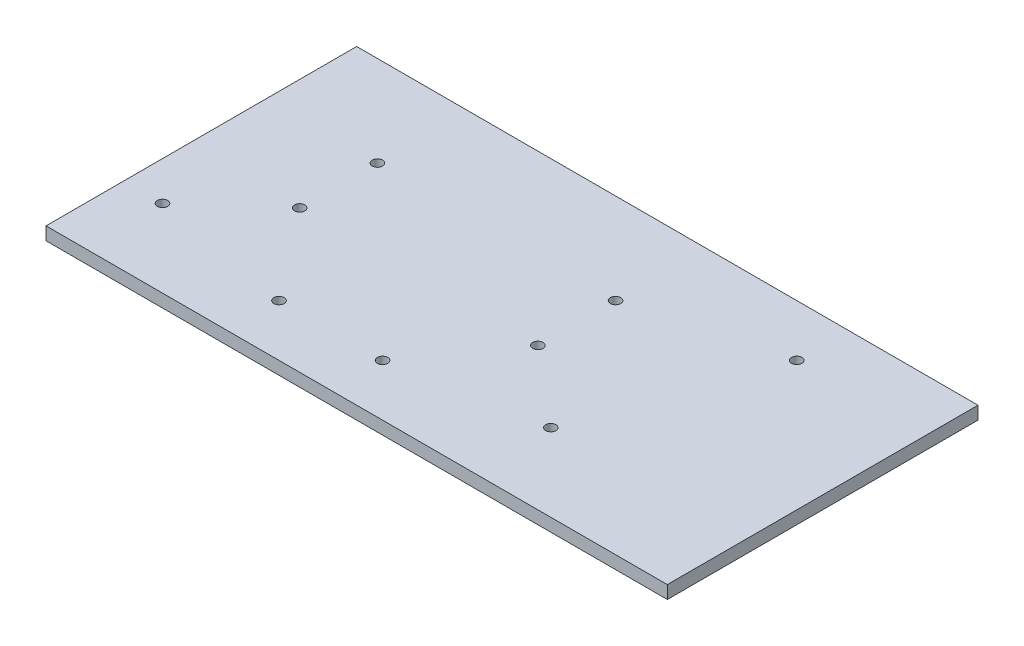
ISO-10303-21;
HEADER;
FILE_DESCRIPTION(('STEP AP214'),'2;1');
FILE_NAME('part.step','',(''),(''),'','','');
FILE_SCHEMA(('AUTOMOTIVE_DESIGN { 1 0 10303 214 1 1 1 1 }'));
ENDSEC;
DATA;
#1=APPLICATION_CONTEXT('core data for automotive mechanical design processes');
#2=APPLICATION_PROTOCOL_DEFINITION('international standard','automotive_design',2000,#1);
#3=PRODUCT_CONTEXT('',#1,'mechanical');
#4=PRODUCT('Part','Part','',(#3));
#5=PRODUCT_RELATED_PRODUCT_CATEGORY('part','',(#4));
#6=PRODUCT_DEFINITION_FORMATION('','',#4);
#7=PRODUCT_DEFINITION_CONTEXT('part definition',#1,'design');
#8=PRODUCT_DEFINITION('design','',#6,#7);
#9=PRODUCT_DEFINITION_SHAPE('','',#8);
#10=(LENGTH_UNIT() NAMED_UNIT(*) SI_UNIT(.MILLI.,.METRE.));
#11=(NAMED_UNIT(*) PLANE_ANGLE_UNIT() SI_UNIT($,.RADIAN.));
#12=(NAMED_UNIT(*) SI_UNIT($,.STERADIAN.) SOLID_ANGLE_UNIT());
#13=UNCERTAINTY_MEASURE_WITH_UNIT(LENGTH_MEASURE(1.E-05),#10,'distance_accuracy_value','');
#14=(GEOMETRIC_REPRESENTATION_CONTEXT(3) GLOBAL_UNCERTAINTY_ASSIGNED_CONTEXT((#13)) GLOBAL_UNIT_ASSIGNED_CONTEXT((#10,
#11,#12)) REPRESENTATION_CONTEXT('',''));
#15=CARTESIAN_POINT('',(0.,0.,0.));
#16=DIRECTION('',(0.,0.,1.));
#17=DIRECTION('',(1.,0.,0.));
#18=AXIS2_PLACEMENT_3D('',#15,#16,#17);
#19=CARTESIAN_POINT('',(0.,5.,-120.));
#20=DIRECTION('',(0.,-1.,0.));
#21=DIRECTION('',(0.,0.,-1.));
#22=AXIS2_PLACEMENT_3D('',#19,#20,#21);
#23=PLANE('',#22);
#24=CARTESIAN_POINT('',(43.,5.,-55.));
#25=DIRECTION('',(0.,1.,0.));
#26=DIRECTION('',(0.,0.,1.));
#27=AXIS2_PLACEMENT_3D('',#24,#25,#26);
#28=CIRCLE('',#27,2.);
#29=CARTESIAN_POINT('',(43.,5.,-53.));
#30=VERTEX_POINT('',#29);
#31=EDGE_CURVE('E139',#30,#30,#28,.T.);
#32=ORIENTED_EDGE('',*,*,#31,.F.);
#33=EDGE_LOOP('',(#32));
#34=FACE_BOUND('',#33,.T.);
#35=CARTESIAN_POINT('',(110.,5.,-20.));
#36=DIRECTION('',(0.,1.,0.));
#37=DIRECTION('',(0.,0.,1.));
#38=AXIS2_PLACEMENT_3D('',#35,#36,#37);
#39=CIRCLE('',#38,2.);
#40=CARTESIAN_POINT('',(110.,5.,-18.));
#41=VERTEX_POINT('',#40);
#42=EDGE_CURVE('E153',#41,#41,#39,.T.);
#43=ORIENTED_EDGE('',*,*,#42,.F.);
#44=EDGE_LOOP('',(#43));
#45=FACE_BOUND('',#44,.T.);
#46=CARTESIAN_POINT('',(15.,5.,-30.));
#47=DIRECTION('',(0.,1.,0.));
#48=DIRECTION('',(0.,0.,1.));
#49=AXIS2_PLACEMENT_3D('',#46,#47,#48);
#50=CIRCLE('',#49,2.);
#51=CARTESIAN_POINT('',(15.,5.,-28.));
#52=VERTEX_POINT('',#51);
#53=EDGE_CURVE('E163',#52,#52,#50,.T.);
#54=ORIENTED_EDGE('',*,*,#53,.F.);
#55=EDGE_LOOP('',(#54));
#56=FACE_BOUND('',#55,.T.);
#57=CARTESIAN_POINT('',(135.,5.,-85.));
#58=DIRECTION('',(0.,1.,0.));
#59=DIRECTION('',(0.,0.,1.));
#60=AXIS2_PLACEMENT_3D('',#57,#58,#59);
#61=CIRCLE('',#60,2.);
#62=CARTESIAN_POINT('',(135.,5.,-83.));
#63=VERTEX_POINT('',#62);
#64=EDGE_CURVE('E173',#63,#63,#61,.T.);
#65=ORIENTED_EDGE('',*,*,#64,.F.);
#66=EDGE_LOOP('',(#65));
#67=FACE_BOUND('',#66,.T.);
#68=DIRECTION('',(0.,0.,1.));
#69=VECTOR('',#68,1.);
#70=CARTESIAN_POINT('',(0.,5.,0.));
#71=LINE('',#70,#69);
#72=CARTESIAN_POINT('',(0.,5.,-120.));
#73=VERTEX_POINT('',#72);
#74=CARTESIAN_POINT('',(0.,5.,0.));
#75=VERTEX_POINT('',#74);
#76=EDGE_CURVE('E101',#73,#75,#71,.T.);
#77=ORIENTED_EDGE('',*,*,#76,.T.);
#78=DIRECTION('',(1.,0.,0.));
#79=VECTOR('',#78,1.);
#80=CARTESIAN_POINT('',(0.,5.,0.));
#81=LINE('',#80,#79);
#82=CARTESIAN_POINT('',(240.,5.,0.));
#83=VERTEX_POINT('',#82);
#84=EDGE_CURVE('E86',#75,#83,#81,.T.);
#85=ORIENTED_EDGE('',*,*,#84,.T.);
#86=DIRECTION('',(0.,0.,-1.));
#87=VECTOR('',#86,1.);
#88=CARTESIAN_POINT('',(240.,5.,0.));
#89=LINE('',#88,#87);
#90=CARTESIAN_POINT('',(240.,5.,-120.));
#91=VERTEX_POINT('',#90);
#92=EDGE_CURVE('E52',#83,#91,#89,.T.);
#93=ORIENTED_EDGE('',*,*,#92,.T.);
#94=DIRECTION('',(-1.,0.,0.));
#95=VECTOR('',#94,1.);
#96=CARTESIAN_POINT('',(0.,5.,-120.));
#97=LINE('',#96,#95);
#98=EDGE_CURVE('E47',#91,#73,#97,.T.);
#99=ORIENTED_EDGE('',*,*,#98,.T.);
#100=EDGE_LOOP('',(#77,#85,#93,#99));
#101=FACE_BOUND('',#100,.T.);
#102=CARTESIAN_POINT('',(190.,5.,-100.));
#103=DIRECTION('',(0.,1.,0.));
#104=DIRECTION('',(0.,0.,1.));
#105=AXIS2_PLACEMENT_3D('',#102,#103,#104);
#106=CIRCLE('',#105,2.);
#107=CARTESIAN_POINT('',(190.,5.,-98.));
#108=VERTEX_POINT('',#107);
#109=EDGE_CURVE('E91',#108,#108,#106,.T.);
#110=ORIENTED_EDGE('',*,*,#109,.F.);
#111=EDGE_LOOP('',(#110));
#112=FACE_BOUND('',#111,.T.);
#113=CARTESIAN_POINT('',(43.,5.,-85.));
#114=DIRECTION('',(0.,1.,0.));
#115=DIRECTION('',(0.,0.,1.));
#116=AXIS2_PLACEMENT_3D('',#113,#114,#115);
#117=CIRCLE('',#116,2.);
#118=CARTESIAN_POINT('',(43.,5.,-83.));
#119=VERTEX_POINT('',#118);
#120=EDGE_CURVE('E122',#119,#119,#117,.T.);
#121=ORIENTED_EDGE('',*,*,#120,.F.);
#122=EDGE_LOOP('',(#121));
#123=FACE_BOUND('',#122,.T.);
#124=CARTESIAN_POINT('',(70.,5.,-20.));
#125=DIRECTION('',(0.,1.,0.));
#126=DIRECTION('',(0.,0.,1.));
#127=AXIS2_PLACEMENT_3D('',#124,#125,#126);
#128=CIRCLE('',#127,2.);
#129=CARTESIAN_POINT('',(70.,5.,-18.));
#130=VERTEX_POINT('',#129);
#131=EDGE_CURVE('E126',#130,#130,#128,.T.);
#132=ORIENTED_EDGE('',*,*,#131,.F.);
#133=EDGE_LOOP('',(#132));
#134=FACE_BOUND('',#133,.T.);
#135=CARTESIAN_POINT('',(165.,5.,-30.));
#136=DIRECTION('',(0.,1.,0.));
#137=DIRECTION('',(0.,0.,1.));
#138=AXIS2_PLACEMENT_3D('',#135,#136,#137);
#139=CIRCLE('',#138,2.);
#140=CARTESIAN_POINT('',(165.,5.,-28.));
#141=VERTEX_POINT('',#140);
#142=EDGE_CURVE('E130',#141,#141,#139,.T.);
#143=ORIENTED_EDGE('',*,*,#142,.F.);
#144=EDGE_LOOP('',(#143));
#145=FACE_BOUND('',#144,.T.);
#146=CARTESIAN_POINT('',(135.,5.,-55.));
#147=DIRECTION('',(0.,1.,0.));
#148=DIRECTION('',(0.,0.,1.));
#149=AXIS2_PLACEMENT_3D('',#146,#147,#148);
#150=CIRCLE('',#149,2.);
#151=CARTESIAN_POINT('',(135.,5.,-53.));
#152=VERTEX_POINT('',#151);
#153=EDGE_CURVE('E133',#152,#152,#150,.T.);
#154=ORIENTED_EDGE('',*,*,#153,.F.);
#155=EDGE_LOOP('',(#154));
#156=FACE_BOUND('',#155,.T.);
#157=ADVANCED_FACE('F32',(#34,#45,#56,#67,#101,#112,#123,#134,#145,#156),#23,.F.);
#158=CARTESIAN_POINT('',(0.,0.,-120.));
#159=DIRECTION('',(0.,-1.,0.));
#160=DIRECTION('',(0.,0.,-1.));
#161=AXIS2_PLACEMENT_3D('',#158,#159,#160);
#162=PLANE('',#161);
#163=CARTESIAN_POINT('',(43.,0.,-55.));
#164=DIRECTION('',(0.,1.,0.));
#165=DIRECTION('',(0.,0.,1.));
#166=AXIS2_PLACEMENT_3D('',#163,#164,#165);
#167=CIRCLE('',#166,2.);
#168=CARTESIAN_POINT('',(43.,0.,-53.));
#169=VERTEX_POINT('',#168);
#170=EDGE_CURVE('E135',#169,#169,#167,.T.);
#171=ORIENTED_EDGE('',*,*,#170,.T.);
#172=EDGE_LOOP('',(#171));
#173=FACE_BOUND('',#172,.T.);
#174=CARTESIAN_POINT('',(110.,0.,-20.));
#175=DIRECTION('',(0.,1.,0.));
#176=DIRECTION('',(0.,0.,1.));
#177=AXIS2_PLACEMENT_3D('',#174,#175,#176);
#178=CIRCLE('',#177,2.);
#179=CARTESIAN_POINT('',(110.,0.,-18.));
#180=VERTEX_POINT('',#179);
#181=EDGE_CURVE('E150',#180,#180,#178,.T.);
#182=ORIENTED_EDGE('',*,*,#181,.T.);
#183=EDGE_LOOP('',(#182));
#184=FACE_BOUND('',#183,.T.);
#185=CARTESIAN_POINT('',(15.,0.,-30.));
#186=DIRECTION('',(0.,1.,0.));
#187=DIRECTION('',(0.,0.,1.));
#188=AXIS2_PLACEMENT_3D('',#185,#186,#187);
#189=CIRCLE('',#188,2.);
#190=CARTESIAN_POINT('',(15.,0.,-28.));
#191=VERTEX_POINT('',#190);
#192=EDGE_CURVE('E160',#191,#191,#189,.T.);
#193=ORIENTED_EDGE('',*,*,#192,.T.);
#194=EDGE_LOOP('',(#193));
#195=FACE_BOUND('',#194,.T.);
#196=CARTESIAN_POINT('',(135.,0.,-85.));
#197=DIRECTION('',(0.,1.,0.));
#198=DIRECTION('',(0.,0.,1.));
#199=AXIS2_PLACEMENT_3D('',#196,#197,#198);
#200=CIRCLE('',#199,2.);
#201=CARTESIAN_POINT('',(135.,0.,-83.));
#202=VERTEX_POINT('',#201);
#203=EDGE_CURVE('E170',#202,#202,#200,.T.);
#204=ORIENTED_EDGE('',*,*,#203,.T.);
#205=EDGE_LOOP('',(#204));
#206=FACE_BOUND('',#205,.T.);
#207=DIRECTION('',(0.,0.,1.));
#208=VECTOR('',#207,1.);
#209=CARTESIAN_POINT('',(0.,0.,0.));
#210=LINE('',#209,#208);
#211=CARTESIAN_POINT('',(0.,0.,-120.));
#212=VERTEX_POINT('',#211);
#213=CARTESIAN_POINT('',(0.,0.,0.));
#214=VERTEX_POINT('',#213);
#215=EDGE_CURVE('E78',#212,#214,#210,.T.);
#216=ORIENTED_EDGE('',*,*,#215,.F.);
#217=DIRECTION('',(-1.,0.,0.));
#218=VECTOR('',#217,1.);
#219=CARTESIAN_POINT('',(0.,0.,-120.));
#220=LINE('',#219,#218);
#221=CARTESIAN_POINT('',(240.,0.,-120.));
#222=VERTEX_POINT('',#221);
#223=EDGE_CURVE('E99',#222,#212,#220,.T.);
#224=ORIENTED_EDGE('',*,*,#223,.F.);
#225=DIRECTION('',(0.,0.,-1.));
#226=VECTOR('',#225,1.);
#227=CARTESIAN_POINT('',(240.,0.,0.));
#228=LINE('',#227,#226);
#229=CARTESIAN_POINT('',(240.,0.,0.));
#230=VERTEX_POINT('',#229);
#231=EDGE_CURVE('E79',#230,#222,#228,.T.);
#232=ORIENTED_EDGE('',*,*,#231,.F.);
#233=DIRECTION('',(1.,0.,0.));
#234=VECTOR('',#233,1.);
#235=CARTESIAN_POINT('',(0.,0.,0.));
#236=LINE('',#235,#234);
#237=EDGE_CURVE('E73',#214,#230,#236,.T.);
#238=ORIENTED_EDGE('',*,*,#237,.F.);
#239=EDGE_LOOP('',(#216,#224,#232,#238));
#240=FACE_BOUND('',#239,.T.);
#241=CARTESIAN_POINT('',(190.,0.,-100.));
#242=DIRECTION('',(0.,1.,0.));
#243=DIRECTION('',(0.,0.,1.));
#244=AXIS2_PLACEMENT_3D('',#241,#242,#243);
#245=CIRCLE('',#244,2.);
#246=CARTESIAN_POINT('',(190.,0.,-98.));
#247=VERTEX_POINT('',#246);
#248=EDGE_CURVE('E94',#247,#247,#245,.T.);
#249=ORIENTED_EDGE('',*,*,#248,.T.);
#250=EDGE_LOOP('',(#249));
#251=FACE_BOUND('',#250,.T.);
#252=CARTESIAN_POINT('',(43.,0.,-85.));
#253=DIRECTION('',(0.,1.,0.));
#254=DIRECTION('',(0.,0.,1.));
#255=AXIS2_PLACEMENT_3D('',#252,#253,#254);
#256=CIRCLE('',#255,2.);
#257=CARTESIAN_POINT('',(43.,0.,-83.));
#258=VERTEX_POINT('',#257);
#259=EDGE_CURVE('E166',#258,#258,#256,.T.);
#260=ORIENTED_EDGE('',*,*,#259,.T.);
#261=EDGE_LOOP('',(#260));
#262=FACE_BOUND('',#261,.T.);
#263=CARTESIAN_POINT('',(70.,0.,-20.));
#264=DIRECTION('',(0.,1.,0.));
#265=DIRECTION('',(0.,0.,1.));
#266=AXIS2_PLACEMENT_3D('',#263,#264,#265);
#267=CIRCLE('',#266,2.);
#268=CARTESIAN_POINT('',(70.,0.,-18.));
#269=VERTEX_POINT('',#268);
#270=EDGE_CURVE('E156',#269,#269,#267,.T.);
#271=ORIENTED_EDGE('',*,*,#270,.T.);
#272=EDGE_LOOP('',(#271));
#273=FACE_BOUND('',#272,.T.);
#274=CARTESIAN_POINT('',(165.,0.,-30.));
#275=DIRECTION('',(0.,1.,0.));
#276=DIRECTION('',(0.,0.,1.));
#277=AXIS2_PLACEMENT_3D('',#274,#275,#276);
#278=CIRCLE('',#277,2.);
#279=CARTESIAN_POINT('',(165.,0.,-28.));
#280=VERTEX_POINT('',#279);
#281=EDGE_CURVE('E146',#280,#280,#278,.T.);
#282=ORIENTED_EDGE('',*,*,#281,.T.);
#283=EDGE_LOOP('',(#282));
#284=FACE_BOUND('',#283,.T.);
#285=CARTESIAN_POINT('',(135.,0.,-55.));
#286=DIRECTION('',(0.,1.,0.));
#287=DIRECTION('',(0.,0.,1.));
#288=AXIS2_PLACEMENT_3D('',#285,#286,#287);
#289=CIRCLE('',#288,2.);
#290=CARTESIAN_POINT('',(135.,0.,-53.));
#291=VERTEX_POINT('',#290);
#292=EDGE_CURVE('E136',#291,#291,#289,.T.);
#293=ORIENTED_EDGE('',*,*,#292,.T.);
#294=EDGE_LOOP('',(#293));
#295=FACE_BOUND('',#294,.T.);
#296=ADVANCED_FACE('F74',(#173,#184,#195,#206,#240,#251,#262,#273,#284,#295),#162,.T.);
#297=CARTESIAN_POINT('',(0.,5.,0.));
#298=DIRECTION('',(1.,0.,0.));
#299=DIRECTION('',(0.,0.,-1.));
#300=AXIS2_PLACEMENT_3D('',#297,#298,#299);
#301=PLANE('',#300);
#302=ORIENTED_EDGE('',*,*,#215,.T.);
#303=DIRECTION('',(0.,-1.,0.));
#304=VECTOR('',#303,1.);
#305=CARTESIAN_POINT('',(0.,5.,0.));
#306=LINE('',#305,#304);
#307=EDGE_CURVE('E11',#75,#214,#306,.T.);
#308=ORIENTED_EDGE('',*,*,#307,.F.);
#309=ORIENTED_EDGE('',*,*,#76,.F.);
#310=DIRECTION('',(0.,-1.,0.));
#311=VECTOR('',#310,1.);
#312=CARTESIAN_POINT('',(0.,5.,-120.));
#313=LINE('',#312,#311);
#314=EDGE_CURVE('E90',#73,#212,#313,.T.);
#315=ORIENTED_EDGE('',*,*,#314,.T.);
#316=EDGE_LOOP('',(#302,#308,#309,#315));
#317=FACE_BOUND('',#316,.T.);
#318=ADVANCED_FACE('F34',(#317),#301,.F.);
#319=CARTESIAN_POINT('',(0.,5.,0.));
#320=DIRECTION('',(0.,0.,-1.));
#321=DIRECTION('',(-1.,0.,0.));
#322=AXIS2_PLACEMENT_3D('',#319,#320,#321);
#323=PLANE('',#322);
#324=ORIENTED_EDGE('',*,*,#237,.T.);
#325=DIRECTION('',(0.,-1.,0.));
#326=VECTOR('',#325,1.);
#327=CARTESIAN_POINT('',(240.,5.,0.));
#328=LINE('',#327,#326);
#329=EDGE_CURVE('E40',#83,#230,#328,.T.);
#330=ORIENTED_EDGE('',*,*,#329,.F.);
#331=ORIENTED_EDGE('',*,*,#84,.F.);
#332=ORIENTED_EDGE('',*,*,#307,.T.);
#333=EDGE_LOOP('',(#324,#330,#331,#332));
#334=FACE_BOUND('',#333,.T.);
#335=ADVANCED_FACE('F85',(#334),#323,.F.);
#336=CARTESIAN_POINT('',(240.,5.,0.));
#337=DIRECTION('',(-1.,0.,0.));
#338=DIRECTION('',(0.,0.,1.));
#339=AXIS2_PLACEMENT_3D('',#336,#337,#338);
#340=PLANE('',#339);
#341=ORIENTED_EDGE('',*,*,#231,.T.);
#342=DIRECTION('',(0.,-1.,0.));
#343=VECTOR('',#342,1.);
#344=CARTESIAN_POINT('',(240.,5.,-120.));
#345=LINE('',#344,#343);
#346=EDGE_CURVE('E107',#91,#222,#345,.T.);
#347=ORIENTED_EDGE('',*,*,#346,.F.);
#348=ORIENTED_EDGE('',*,*,#92,.F.);
#349=ORIENTED_EDGE('',*,*,#329,.T.);
#350=EDGE_LOOP('',(#341,#347,#348,#349));
#351=FACE_BOUND('',#350,.T.);
#352=ADVANCED_FACE('F110',(#351),#340,.F.);
#353=CARTESIAN_POINT('',(0.,5.,-120.));
#354=DIRECTION('',(0.,0.,1.));
#355=DIRECTION('',(1.,0.,0.));
#356=AXIS2_PLACEMENT_3D('',#353,#354,#355);
#357=PLANE('',#356);
#358=ORIENTED_EDGE('',*,*,#223,.T.);
#359=ORIENTED_EDGE('',*,*,#314,.F.);
#360=ORIENTED_EDGE('',*,*,#98,.F.);
#361=ORIENTED_EDGE('',*,*,#346,.T.);
#362=EDGE_LOOP('',(#358,#359,#360,#361));
#363=FACE_BOUND('',#362,.T.);
#364=ADVANCED_FACE('F112',(#363),#357,.F.);
#365=CARTESIAN_POINT('',(190.,5.,-100.));
#366=DIRECTION('',(0.,-1.,0.));
#367=DIRECTION('',(0.,0.,-1.));
#368=AXIS2_PLACEMENT_3D('',#365,#366,#367);
#369=CYLINDRICAL_SURFACE('',#368,2.);
#370=ORIENTED_EDGE('',*,*,#109,.T.);
#371=EDGE_LOOP('',(#370));
#372=FACE_BOUND('',#371,.T.);
#373=ORIENTED_EDGE('',*,*,#248,.F.);
#374=EDGE_LOOP('',(#373));
#375=FACE_BOUND('',#374,.T.);
#376=ADVANCED_FACE('F179',(#372,#375),#369,.F.);
#377=CARTESIAN_POINT('',(135.,5.,-85.));
#378=DIRECTION('',(0.,-1.,0.));
#379=DIRECTION('',(0.,0.,-1.));
#380=AXIS2_PLACEMENT_3D('',#377,#378,#379);
#381=CYLINDRICAL_SURFACE('',#380,2.);
#382=ORIENTED_EDGE('',*,*,#64,.T.);
#383=EDGE_LOOP('',(#382));
#384=FACE_BOUND('',#383,.T.);
#385=ORIENTED_EDGE('',*,*,#203,.F.);
#386=EDGE_LOOP('',(#385));
#387=FACE_BOUND('',#386,.T.);
#388=ADVANCED_FACE('F181',(#384,#387),#381,.F.);
#389=CARTESIAN_POINT('',(43.,5.,-85.));
#390=DIRECTION('',(0.,-1.,0.));
#391=DIRECTION('',(0.,0.,-1.));
#392=AXIS2_PLACEMENT_3D('',#389,#390,#391);
#393=CYLINDRICAL_SURFACE('',#392,2.);
#394=ORIENTED_EDGE('',*,*,#120,.T.);
#395=EDGE_LOOP('',(#394));
#396=FACE_BOUND('',#395,.T.);
#397=ORIENTED_EDGE('',*,*,#259,.F.);
#398=EDGE_LOOP('',(#397));
#399=FACE_BOUND('',#398,.T.);
#400=ADVANCED_FACE('F188',(#396,#399),#393,.F.);
#401=CARTESIAN_POINT('',(15.,5.,-30.));
#402=DIRECTION('',(0.,-1.,0.));
#403=DIRECTION('',(0.,0.,-1.));
#404=AXIS2_PLACEMENT_3D('',#401,#402,#403);
#405=CYLINDRICAL_SURFACE('',#404,2.);
#406=ORIENTED_EDGE('',*,*,#53,.T.);
#407=EDGE_LOOP('',(#406));
#408=FACE_BOUND('',#407,.T.);
#409=ORIENTED_EDGE('',*,*,#192,.F.);
#410=EDGE_LOOP('',(#409));
#411=FACE_BOUND('',#410,.T.);
#412=ADVANCED_FACE('F251',(#408,#411),#405,.F.);
#413=CARTESIAN_POINT('',(70.,5.,-20.));
#414=DIRECTION('',(0.,-1.,0.));
#415=DIRECTION('',(0.,0.,-1.));
#416=AXIS2_PLACEMENT_3D('',#413,#414,#415);
#417=CYLINDRICAL_SURFACE('',#416,2.);
#418=ORIENTED_EDGE('',*,*,#131,.T.);
#419=EDGE_LOOP('',(#418));
#420=FACE_BOUND('',#419,.T.);
#421=ORIENTED_EDGE('',*,*,#270,.F.);
#422=EDGE_LOOP('',(#421));
#423=FACE_BOUND('',#422,.T.);
#424=ADVANCED_FACE('F260',(#420,#423),#417,.F.);
#425=CARTESIAN_POINT('',(110.,5.,-20.));
#426=DIRECTION('',(0.,-1.,0.));
#427=DIRECTION('',(0.,0.,-1.));
#428=AXIS2_PLACEMENT_3D('',#425,#426,#427);
#429=CYLINDRICAL_SURFACE('',#428,2.);
#430=ORIENTED_EDGE('',*,*,#42,.T.);
#431=EDGE_LOOP('',(#430));
#432=FACE_BOUND('',#431,.T.);
#433=ORIENTED_EDGE('',*,*,#181,.F.);
#434=EDGE_LOOP('',(#433));
#435=FACE_BOUND('',#434,.T.);
#436=ADVANCED_FACE('F270',(#432,#435),#429,.F.);
#437=CARTESIAN_POINT('',(165.,5.,-30.));
#438=DIRECTION('',(0.,-1.,0.));
#439=DIRECTION('',(0.,0.,-1.));
#440=AXIS2_PLACEMENT_3D('',#437,#438,#439);
#441=CYLINDRICAL_SURFACE('',#440,2.);
#442=ORIENTED_EDGE('',*,*,#142,.T.);
#443=EDGE_LOOP('',(#442));
#444=FACE_BOUND('',#443,.T.);
#445=ORIENTED_EDGE('',*,*,#281,.F.);
#446=EDGE_LOOP('',(#445));
#447=FACE_BOUND('',#446,.T.);
#448=ADVANCED_FACE('F280',(#444,#447),#441,.F.);
#449=CARTESIAN_POINT('',(43.,5.,-55.));
#450=DIRECTION('',(0.,-1.,0.));
#451=DIRECTION('',(0.,0.,-1.));
#452=AXIS2_PLACEMENT_3D('',#449,#450,#451);
#453=CYLINDRICAL_SURFACE('',#452,2.);
#454=ORIENTED_EDGE('',*,*,#31,.T.);
#455=EDGE_LOOP('',(#454));
#456=FACE_BOUND('',#455,.T.);
#457=ORIENTED_EDGE('',*,*,#170,.F.);
#458=EDGE_LOOP('',(#457));
#459=FACE_BOUND('',#458,.T.);
#460=ADVANCED_FACE('F290',(#456,#459),#453,.F.);
#461=CARTESIAN_POINT('',(135.,5.,-55.));
#462=DIRECTION('',(0.,-1.,0.));
#463=DIRECTION('',(0.,0.,-1.));
#464=AXIS2_PLACEMENT_3D('',#461,#462,#463);
#465=CYLINDRICAL_SURFACE('',#464,2.);
#466=ORIENTED_EDGE('',*,*,#153,.T.);
#467=EDGE_LOOP('',(#466));
#468=FACE_BOUND('',#467,.T.);
#469=ORIENTED_EDGE('',*,*,#292,.F.);
#470=EDGE_LOOP('',(#469));
#471=FACE_BOUND('',#470,.T.);
#472=ADVANCED_FACE('F300',(#468,#471),#465,.F.);
#473=CLOSED_SHELL('',(#157,#296,#318,#335,#352,#364,#376,#388,#400,#412,#424,#436,#448,#460,#472));
#474=MANIFOLD_SOLID_BREP('B2',#473);
#475=ADVANCED_BREP_SHAPE_REPRESENTATION('',(#18,#474),#14);
#476=SHAPE_DEFINITION_REPRESENTATION(#9,#475);
ENDSEC;
END-ISO-10303-21;
